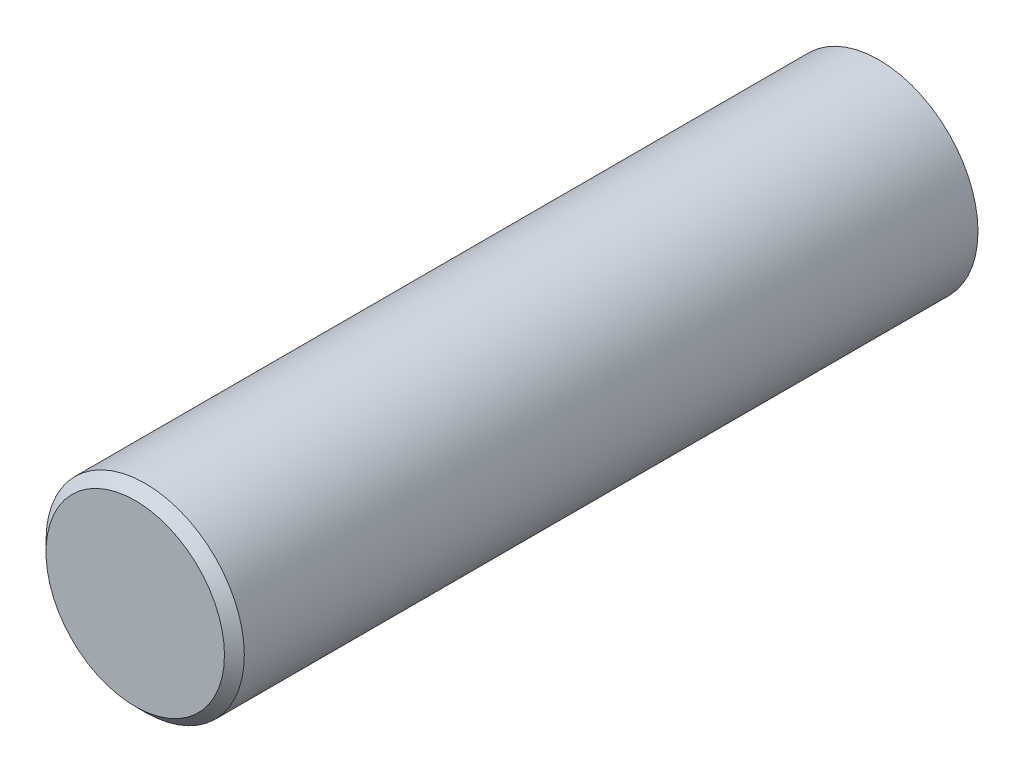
from build123d import *

# Parameters (mm, degrees)
ESQUISSE1_R      = 8
EXTRUSION1_DEPTH = 60
CHANFREIN1_SIZE  = 0.8


with BuildPart() as part:
    # Esquisse1 → Extrusion1 (new body)
    with BuildSketch(Plane.XY):
        Circle(ESQUISSE1_R)
    extrude(amount=EXTRUSION1_DEPTH)

    # Chanfrein1
    chanfrein1_edges = [part.edges().sort_by_distance(p)[0] for p in [
        (-8, 0, 60),
    ]]
    chamfer(chanfrein1_edges, length=CHANFREIN1_SIZE)


solid = part.part
